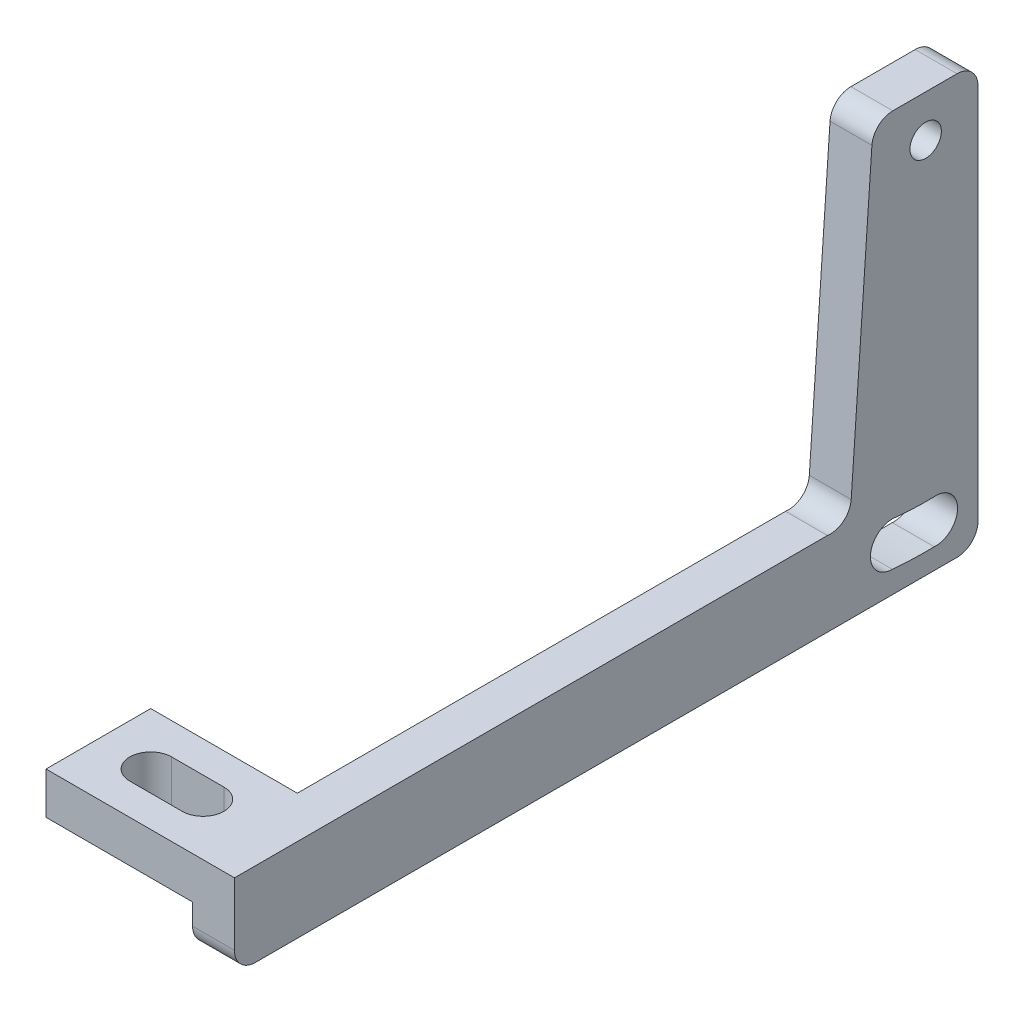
ISO-10303-21;
HEADER;
FILE_DESCRIPTION(('STEP AP214'),'2;1');
FILE_NAME('part.step','',(''),(''),'','','');
FILE_SCHEMA(('AUTOMOTIVE_DESIGN { 1 0 10303 214 1 1 1 1 }'));
ENDSEC;
DATA;
#1=APPLICATION_CONTEXT('core data for automotive mechanical design processes');
#2=APPLICATION_PROTOCOL_DEFINITION('international standard','automotive_design',2000,#1);
#3=PRODUCT_CONTEXT('',#1,'mechanical');
#4=PRODUCT('Part','Part','',(#3));
#5=PRODUCT_RELATED_PRODUCT_CATEGORY('part','',(#4));
#6=PRODUCT_DEFINITION_FORMATION('','',#4);
#7=PRODUCT_DEFINITION_CONTEXT('part definition',#1,'design');
#8=PRODUCT_DEFINITION('design','',#6,#7);
#9=PRODUCT_DEFINITION_SHAPE('','',#8);
#10=(LENGTH_UNIT() NAMED_UNIT(*) SI_UNIT(.MILLI.,.METRE.));
#11=(NAMED_UNIT(*) PLANE_ANGLE_UNIT() SI_UNIT($,.RADIAN.));
#12=(NAMED_UNIT(*) SI_UNIT($,.STERADIAN.) SOLID_ANGLE_UNIT());
#13=UNCERTAINTY_MEASURE_WITH_UNIT(LENGTH_MEASURE(1.E-05),#10,'distance_accuracy_value','');
#14=(GEOMETRIC_REPRESENTATION_CONTEXT(3) GLOBAL_UNCERTAINTY_ASSIGNED_CONTEXT((#13)) GLOBAL_UNIT_ASSIGNED_CONTEXT((#10,
#11,#12)) REPRESENTATION_CONTEXT('',''));
#15=CARTESIAN_POINT('',(0.,0.,0.));
#16=DIRECTION('',(0.,0.,1.));
#17=DIRECTION('',(1.,0.,0.));
#18=AXIS2_PLACEMENT_3D('',#15,#16,#17);
#19=CARTESIAN_POINT('',(0.,-44.7113522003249,-90.6066732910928));
#20=DIRECTION('',(1.,0.,0.));
#21=DIRECTION('',(0.,0.,-1.));
#22=AXIS2_PLACEMENT_3D('',#19,#20,#21);
#23=PLANE('',#22);
#24=CARTESIAN_POINT('',(0.,-50.7288013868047,-1.53453655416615));
#25=DIRECTION('',(1.,0.,0.));
#26=DIRECTION('',(0.,0.,-1.));
#27=AXIS2_PLACEMENT_3D('',#24,#25,#26);
#28=CIRCLE('',#27,3.30199999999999);
#29=CARTESIAN_POINT('',(0.,-54.0217341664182,-1.29000085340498));
#30=VERTEX_POINT('',#29);
#31=CARTESIAN_POINT('',(0.,-47.4530595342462,-1.11894142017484));
#32=VERTEX_POINT('',#31);
#33=EDGE_CURVE('E389',#30,#32,#28,.T.);
#34=ORIENTED_EDGE('',*,*,#33,.T.);
#35=CARTESIAN_POINT('',(0.,0.,0.));
#36=DIRECTION('',(1.,0.,0.));
#37=DIRECTION('',(0.,0.,-1.));
#38=AXIS2_PLACEMENT_3D('',#35,#36,#37);
#39=CIRCLE('',#38,47.46625);
#40=CARTESIAN_POINT('',(0.,-47.2609856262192,4.40954948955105));
#41=VERTEX_POINT('',#40);
#42=EDGE_CURVE('E422',#41,#32,#39,.T.);
#43=ORIENTED_EDGE('',*,*,#42,.F.);
#44=CARTESIAN_POINT('',(0.,-50.4971968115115,5.06540096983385));
#45=DIRECTION('',(1.,0.,0.));
#46=DIRECTION('',(0.,0.,-1.));
#47=AXIS2_PLACEMENT_3D('',#44,#45,#46);
#48=CIRCLE('',#47,3.302);
#49=CARTESIAN_POINT('',(0.,-53.7991968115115,5.06540096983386));
#50=VERTEX_POINT('',#49);
#51=EDGE_CURVE('E426',#41,#50,#48,.T.);
#52=ORIENTED_EDGE('',*,*,#51,.T.);
#53=CARTESIAN_POINT('',(0.,0.,0.));
#54=DIRECTION('',(1.,0.,0.));
#55=DIRECTION('',(0.,0.,-1.));
#56=AXIS2_PLACEMENT_3D('',#53,#54,#55);
#57=CIRCLE('',#56,54.0371341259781);
#58=EDGE_CURVE('E428',#50,#30,#57,.T.);
#59=ORIENTED_EDGE('',*,*,#58,.T.);
#60=EDGE_LOOP('',(#34,#43,#52,#59));
#61=FACE_BOUND('',#60,.T.);
#62=CARTESIAN_POINT('',(0.,0.,0.));
#63=DIRECTION('',(1.,0.,0.));
#64=DIRECTION('',(0.,0.,-1.));
#65=AXIS2_PLACEMENT_3D('',#62,#63,#64);
#66=CIRCLE('',#65,2.38125);
#67=CARTESIAN_POINT('',(0.,0.,-2.38125));
#68=VERTEX_POINT('',#67);
#69=EDGE_CURVE('E358',#68,#68,#66,.T.);
#70=ORIENTED_EDGE('',*,*,#69,.T.);
#71=EDGE_LOOP('',(#70));
#72=FACE_BOUND('',#71,.T.);
#73=DIRECTION('',(0.,-1.,0.));
#74=VECTOR('',#73,1.);
#75=CARTESIAN_POINT('',(0.,-44.45,88.9));
#76=LINE('',#75,#74);
#77=CARTESIAN_POINT('',(0.,-44.45,88.9));
#78=VERTEX_POINT('',#77);
#79=CARTESIAN_POINT('',(0.,-50.8,88.9));
#80=VERTEX_POINT('',#79);
#81=EDGE_CURVE('E217',#78,#80,#76,.T.);
#82=ORIENTED_EDGE('',*,*,#81,.F.);
#83=DIRECTION('',(0.,0.,-1.));
#84=VECTOR('',#83,1.);
#85=CARTESIAN_POINT('',(0.,-44.45,-90.6066732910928));
#86=LINE('',#85,#84);
#87=CARTESIAN_POINT('',(0.,-44.45,14.8945527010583));
#88=VERTEX_POINT('',#87);
#89=EDGE_CURVE('E240',#78,#88,#86,.T.);
#90=ORIENTED_EDGE('',*,*,#89,.T.);
#91=CARTESIAN_POINT('',(0.,-41.3058988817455,14.4526781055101));
#92=DIRECTION('',(1.,0.,0.));
#93=DIRECTION('',(0.,0.,-1.));
#94=AXIS2_PLACEMENT_3D('',#91,#92,#93);
#95=CIRCLE('',#94,3.175);
#96=CARTESIAN_POINT('',(0.,-41.5273756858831,11.2854122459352));
#97=VERTEX_POINT('',#96);
#98=EDGE_CURVE('E383',#88,#97,#95,.T.);
#99=ORIENTED_EDGE('',*,*,#98,.T.);
#100=DIRECTION('',(0.,0.997564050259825,-0.0697564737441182));
#101=VECTOR('',#100,1.);
#102=CARTESIAN_POINT('',(0.,-37.605540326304,11.0111708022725));
#103=LINE('',#102,#101);
#104=CARTESIAN_POINT('',(0.,3.39647680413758,8.14403046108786));
#105=VERTEX_POINT('',#104);
#106=EDGE_CURVE('E380',#97,#105,#103,.T.);
#107=ORIENTED_EDGE('',*,*,#106,.T.);
#108=CARTESIAN_POINT('',(0.,3.175,4.97676460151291));
#109=DIRECTION('',(1.,0.,0.));
#110=DIRECTION('',(0.,0.,-1.));
#111=AXIS2_PLACEMENT_3D('',#108,#109,#110);
#112=CIRCLE('',#111,3.175);
#113=CARTESIAN_POINT('',(0.,6.35,4.9767646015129));
#114=VERTEX_POINT('',#113);
#115=EDGE_CURVE('E377',#114,#105,#112,.T.);
#116=ORIENTED_EDGE('',*,*,#115,.F.);
#117=DIRECTION('',(0.,0.,-1.));
#118=VECTOR('',#117,1.);
#119=CARTESIAN_POINT('',(0.,6.34999999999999,-90.6066732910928));
#120=LINE('',#119,#118);
#121=CARTESIAN_POINT('',(0.,6.35,-4.76249999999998));
#122=VERTEX_POINT('',#121);
#123=EDGE_CURVE('E374',#114,#122,#120,.T.);
#124=ORIENTED_EDGE('',*,*,#123,.T.);
#125=CARTESIAN_POINT('',(0.,3.175,-4.7625));
#126=DIRECTION('',(1.,0.,0.));
#127=DIRECTION('',(0.,0.,-1.));
#128=AXIS2_PLACEMENT_3D('',#125,#126,#127);
#129=CIRCLE('',#128,3.175);
#130=CARTESIAN_POINT('',(0.,3.17499999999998,-7.93750000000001));
#131=VERTEX_POINT('',#130);
#132=EDGE_CURVE('E371',#122,#131,#129,.F.);
#133=ORIENTED_EDGE('',*,*,#132,.T.);
#134=DIRECTION('',(0.,-1.,0.));
#135=VECTOR('',#134,1.);
#136=CARTESIAN_POINT('',(0.,-44.711352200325,-7.93750000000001));
#137=LINE('',#136,#135);
#138=CARTESIAN_POINT('',(0.,-53.975,-7.93750000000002));
#139=VERTEX_POINT('',#138);
#140=EDGE_CURVE('E366',#131,#139,#137,.T.);
#141=ORIENTED_EDGE('',*,*,#140,.T.);
#142=CARTESIAN_POINT('',(0.,-53.975,-4.76250000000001));
#143=DIRECTION('',(1.,0.,0.));
#144=DIRECTION('',(0.,0.,-1.));
#145=AXIS2_PLACEMENT_3D('',#142,#143,#144);
#146=CIRCLE('',#145,3.175);
#147=CARTESIAN_POINT('',(0.,-57.15,-4.76249999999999));
#148=VERTEX_POINT('',#147);
#149=EDGE_CURVE('E364',#139,#148,#146,.F.);
#150=ORIENTED_EDGE('',*,*,#149,.T.);
#151=DIRECTION('',(0.,0.,1.));
#152=VECTOR('',#151,1.);
#153=CARTESIAN_POINT('',(0.,-57.15,-90.6066732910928));
#154=LINE('',#153,#152);
#155=CARTESIAN_POINT('',(0.,-57.15,101.6));
#156=VERTEX_POINT('',#155);
#157=EDGE_CURVE('E357',#148,#156,#154,.T.);
#158=ORIENTED_EDGE('',*,*,#157,.T.);
#159=CARTESIAN_POINT('',(0.,-53.975,101.6));
#160=DIRECTION('',(1.,0.,0.));
#161=DIRECTION('',(0.,0.,-1.));
#162=AXIS2_PLACEMENT_3D('',#159,#160,#161);
#163=CIRCLE('',#162,3.175);
#164=CARTESIAN_POINT('',(0.,-53.975,104.775));
#165=VERTEX_POINT('',#164);
#166=EDGE_CURVE('E349',#156,#165,#163,.F.);
#167=ORIENTED_EDGE('',*,*,#166,.T.);
#168=DIRECTION('',(0.,1.,0.));
#169=VECTOR('',#168,1.);
#170=CARTESIAN_POINT('',(0.,-44.7113522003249,104.775));
#171=LINE('',#170,#169);
#172=CARTESIAN_POINT('',(0.,-50.8,104.775));
#173=VERTEX_POINT('',#172);
#174=EDGE_CURVE('E391',#165,#173,#171,.T.);
#175=ORIENTED_EDGE('',*,*,#174,.T.);
#176=DIRECTION('',(0.,0.,1.));
#177=VECTOR('',#176,1.);
#178=CARTESIAN_POINT('',(0.,-50.8,88.9));
#179=LINE('',#178,#177);
#180=EDGE_CURVE('E224',#80,#173,#179,.T.);
#181=ORIENTED_EDGE('',*,*,#180,.F.);
#182=EDGE_LOOP('',(#82,#90,#99,#107,#116,#124,#133,#141,#150,#158,#167,#175,#181));
#183=FACE_BOUND('',#182,.T.);
#184=ADVANCED_FACE('F42',(#61,#72,#183),#23,.F.);
#185=CARTESIAN_POINT('',(6.35,-50.7288013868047,-1.53453655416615));
#186=DIRECTION('',(-1.,0.,0.));
#187=DIRECTION('',(0.,0.,1.));
#188=AXIS2_PLACEMENT_3D('',#185,#186,#187);
#189=CYLINDRICAL_SURFACE('',#188,3.30199999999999);
#190=ORIENTED_EDGE('',*,*,#33,.F.);
#191=DIRECTION('',(-1.,0.,0.));
#192=VECTOR('',#191,1.);
#193=CARTESIAN_POINT('',(6.35,-54.0217341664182,-1.29000085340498));
#194=LINE('',#193,#192);
#195=CARTESIAN_POINT('',(6.35,-54.0217341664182,-1.29000085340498));
#196=VERTEX_POINT('',#195);
#197=EDGE_CURVE('E258',#196,#30,#194,.T.);
#198=ORIENTED_EDGE('',*,*,#197,.F.);
#199=CARTESIAN_POINT('',(6.35,-50.7288013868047,-1.53453655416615));
#200=DIRECTION('',(1.,0.,0.));
#201=DIRECTION('',(0.,0.,-1.));
#202=AXIS2_PLACEMENT_3D('',#199,#200,#201);
#203=CIRCLE('',#202,3.30199999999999);
#204=CARTESIAN_POINT('',(6.35,-47.4530595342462,-1.11894142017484));
#205=VERTEX_POINT('',#204);
#206=EDGE_CURVE('E437',#196,#205,#203,.T.);
#207=ORIENTED_EDGE('',*,*,#206,.T.);
#208=DIRECTION('',(-1.,0.,0.));
#209=VECTOR('',#208,1.);
#210=CARTESIAN_POINT('',(6.35,-47.4530595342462,-1.11894142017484));
#211=LINE('',#210,#209);
#212=EDGE_CURVE('E394',#205,#32,#211,.T.);
#213=ORIENTED_EDGE('',*,*,#212,.T.);
#214=EDGE_LOOP('',(#190,#198,#207,#213));
#215=FACE_BOUND('',#214,.T.);
#216=ADVANCED_FACE('F279',(#215),#189,.F.);
#217=CARTESIAN_POINT('',(6.35,0.,0.));
#218=DIRECTION('',(-1.,0.,0.));
#219=DIRECTION('',(0.,0.,1.));
#220=AXIS2_PLACEMENT_3D('',#217,#218,#219);
#221=CYLINDRICAL_SURFACE('',#220,54.0371341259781);
#222=ORIENTED_EDGE('',*,*,#58,.F.);
#223=DIRECTION('',(-1.,0.,0.));
#224=VECTOR('',#223,1.);
#225=CARTESIAN_POINT('',(6.35,-53.7991968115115,5.06540096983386));
#226=LINE('',#225,#224);
#227=CARTESIAN_POINT('',(6.35,-53.7991968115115,5.06540096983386));
#228=VERTEX_POINT('',#227);
#229=EDGE_CURVE('E417',#228,#50,#226,.T.);
#230=ORIENTED_EDGE('',*,*,#229,.F.);
#231=CARTESIAN_POINT('',(6.35,0.,0.));
#232=DIRECTION('',(1.,0.,0.));
#233=DIRECTION('',(0.,0.,-1.));
#234=AXIS2_PLACEMENT_3D('',#231,#232,#233);
#235=CIRCLE('',#234,54.0371341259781);
#236=EDGE_CURVE('E444',#228,#196,#235,.T.);
#237=ORIENTED_EDGE('',*,*,#236,.T.);
#238=ORIENTED_EDGE('',*,*,#197,.T.);
#239=EDGE_LOOP('',(#222,#230,#237,#238));
#240=FACE_BOUND('',#239,.T.);
#241=ADVANCED_FACE('F285',(#240),#221,.F.);
#242=CARTESIAN_POINT('',(6.35,-50.4971968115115,5.06540096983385));
#243=DIRECTION('',(-1.,0.,0.));
#244=DIRECTION('',(0.,0.,1.));
#245=AXIS2_PLACEMENT_3D('',#242,#243,#244);
#246=CYLINDRICAL_SURFACE('',#245,3.302);
#247=ORIENTED_EDGE('',*,*,#51,.F.);
#248=DIRECTION('',(-1.,0.,0.));
#249=VECTOR('',#248,1.);
#250=CARTESIAN_POINT('',(6.35,-47.2609856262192,4.40954948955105));
#251=LINE('',#250,#249);
#252=CARTESIAN_POINT('',(6.35,-47.2609856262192,4.40954948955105));
#253=VERTEX_POINT('',#252);
#254=EDGE_CURVE('E419',#253,#41,#251,.T.);
#255=ORIENTED_EDGE('',*,*,#254,.F.);
#256=CARTESIAN_POINT('',(6.35,-50.4971968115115,5.06540096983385));
#257=DIRECTION('',(1.,0.,0.));
#258=DIRECTION('',(0.,0.,-1.));
#259=AXIS2_PLACEMENT_3D('',#256,#257,#258);
#260=CIRCLE('',#259,3.302);
#261=EDGE_CURVE('E441',#253,#228,#260,.T.);
#262=ORIENTED_EDGE('',*,*,#261,.T.);
#263=ORIENTED_EDGE('',*,*,#229,.T.);
#264=EDGE_LOOP('',(#247,#255,#262,#263));
#265=FACE_BOUND('',#264,.T.);
#266=ADVANCED_FACE('F298',(#265),#246,.F.);
#267=CARTESIAN_POINT('',(6.35,-53.975,101.6));
#268=DIRECTION('',(-1.,0.,0.));
#269=DIRECTION('',(0.,0.,1.));
#270=AXIS2_PLACEMENT_3D('',#267,#268,#269);
#271=CYLINDRICAL_SURFACE('',#270,3.175);
#272=ORIENTED_EDGE('',*,*,#166,.F.);
#273=DIRECTION('',(-1.,0.,0.));
#274=VECTOR('',#273,1.);
#275=CARTESIAN_POINT('',(6.35,-57.15,101.6));
#276=LINE('',#275,#274);
#277=CARTESIAN_POINT('',(6.35,-57.15,101.6));
#278=VERTEX_POINT('',#277);
#279=EDGE_CURVE('E352',#278,#156,#276,.T.);
#280=ORIENTED_EDGE('',*,*,#279,.F.);
#281=CARTESIAN_POINT('',(6.35,-53.975,101.6));
#282=DIRECTION('',(1.,0.,0.));
#283=DIRECTION('',(0.,0.,-1.));
#284=AXIS2_PLACEMENT_3D('',#281,#282,#283);
#285=CIRCLE('',#284,3.175);
#286=CARTESIAN_POINT('',(6.35,-53.975,104.775));
#287=VERTEX_POINT('',#286);
#288=EDGE_CURVE('E497',#278,#287,#285,.F.);
#289=ORIENTED_EDGE('',*,*,#288,.T.);
#290=DIRECTION('',(-1.,0.,0.));
#291=VECTOR('',#290,1.);
#292=CARTESIAN_POINT('',(6.35,-53.975,104.775));
#293=LINE('',#292,#291);
#294=EDGE_CURVE('E354',#287,#165,#293,.T.);
#295=ORIENTED_EDGE('',*,*,#294,.T.);
#296=EDGE_LOOP('',(#272,#280,#289,#295));
#297=FACE_BOUND('',#296,.T.);
#298=ADVANCED_FACE('F301',(#297),#271,.T.);
#299=CARTESIAN_POINT('',(6.35,-57.15,-90.6066732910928));
#300=DIRECTION('',(0.,-1.,0.));
#301=DIRECTION('',(0.,0.,-1.));
#302=AXIS2_PLACEMENT_3D('',#299,#300,#301);
#303=PLANE('',#302);
#304=ORIENTED_EDGE('',*,*,#157,.F.);
#305=DIRECTION('',(-1.,0.,0.));
#306=VECTOR('',#305,1.);
#307=CARTESIAN_POINT('',(6.35,-57.15,-4.76249999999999));
#308=LINE('',#307,#306);
#309=CARTESIAN_POINT('',(6.35,-57.15,-4.76249999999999));
#310=VERTEX_POINT('',#309);
#311=EDGE_CURVE('E395',#310,#148,#308,.T.);
#312=ORIENTED_EDGE('',*,*,#311,.F.);
#313=DIRECTION('',(0.,0.,1.));
#314=VECTOR('',#313,1.);
#315=CARTESIAN_POINT('',(6.35,-57.15,-90.6066732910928));
#316=LINE('',#315,#314);
#317=EDGE_CURVE('E494',#310,#278,#316,.T.);
#318=ORIENTED_EDGE('',*,*,#317,.T.);
#319=ORIENTED_EDGE('',*,*,#279,.T.);
#320=EDGE_LOOP('',(#304,#312,#318,#319));
#321=FACE_BOUND('',#320,.T.);
#322=ADVANCED_FACE('F339',(#321),#303,.T.);
#323=CARTESIAN_POINT('',(6.35,-53.975,-4.76250000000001));
#324=DIRECTION('',(-1.,0.,0.));
#325=DIRECTION('',(0.,0.,1.));
#326=AXIS2_PLACEMENT_3D('',#323,#324,#325);
#327=CYLINDRICAL_SURFACE('',#326,3.175);
#328=ORIENTED_EDGE('',*,*,#149,.F.);
#329=DIRECTION('',(-1.,0.,0.));
#330=VECTOR('',#329,1.);
#331=CARTESIAN_POINT('',(6.35,-53.975,-7.93750000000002));
#332=LINE('',#331,#330);
#333=CARTESIAN_POINT('',(6.35,-53.975,-7.93750000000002));
#334=VERTEX_POINT('',#333);
#335=EDGE_CURVE('E397',#334,#139,#332,.T.);
#336=ORIENTED_EDGE('',*,*,#335,.F.);
#337=CARTESIAN_POINT('',(6.35,-53.975,-4.76250000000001));
#338=DIRECTION('',(1.,0.,0.));
#339=DIRECTION('',(0.,0.,-1.));
#340=AXIS2_PLACEMENT_3D('',#337,#338,#339);
#341=CIRCLE('',#340,3.175);
#342=EDGE_CURVE('E491',#334,#310,#341,.F.);
#343=ORIENTED_EDGE('',*,*,#342,.T.);
#344=ORIENTED_EDGE('',*,*,#311,.T.);
#345=EDGE_LOOP('',(#328,#336,#343,#344));
#346=FACE_BOUND('',#345,.T.);
#347=ADVANCED_FACE('F335',(#346),#327,.T.);
#348=CARTESIAN_POINT('',(6.35,-44.711352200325,-7.93750000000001));
#349=DIRECTION('',(0.,0.,-1.));
#350=DIRECTION('',(0.,1.,0.));
#351=AXIS2_PLACEMENT_3D('',#348,#349,#350);
#352=PLANE('',#351);
#353=ORIENTED_EDGE('',*,*,#140,.F.);
#354=DIRECTION('',(-1.,0.,0.));
#355=VECTOR('',#354,1.);
#356=CARTESIAN_POINT('',(6.35,3.17499999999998,-7.93750000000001));
#357=LINE('',#356,#355);
#358=CARTESIAN_POINT('',(6.35,3.17499999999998,-7.93750000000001));
#359=VERTEX_POINT('',#358);
#360=EDGE_CURVE('E399',#359,#131,#357,.T.);
#361=ORIENTED_EDGE('',*,*,#360,.F.);
#362=DIRECTION('',(0.,-1.,0.));
#363=VECTOR('',#362,1.);
#364=CARTESIAN_POINT('',(6.35,-44.711352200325,-7.93750000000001));
#365=LINE('',#364,#363);
#366=EDGE_CURVE('E488',#359,#334,#365,.T.);
#367=ORIENTED_EDGE('',*,*,#366,.T.);
#368=ORIENTED_EDGE('',*,*,#335,.T.);
#369=EDGE_LOOP('',(#353,#361,#367,#368));
#370=FACE_BOUND('',#369,.T.);
#371=ADVANCED_FACE('F331',(#370),#352,.T.);
#372=CARTESIAN_POINT('',(6.35,3.175,-4.7625));
#373=DIRECTION('',(-1.,0.,0.));
#374=DIRECTION('',(0.,0.,1.));
#375=AXIS2_PLACEMENT_3D('',#372,#373,#374);
#376=CYLINDRICAL_SURFACE('',#375,3.175);
#377=ORIENTED_EDGE('',*,*,#132,.F.);
#378=DIRECTION('',(-1.,0.,0.));
#379=VECTOR('',#378,1.);
#380=CARTESIAN_POINT('',(6.35,6.35,-4.76249999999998));
#381=LINE('',#380,#379);
#382=CARTESIAN_POINT('',(6.35,6.35,-4.76249999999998));
#383=VERTEX_POINT('',#382);
#384=EDGE_CURVE('E401',#383,#122,#381,.T.);
#385=ORIENTED_EDGE('',*,*,#384,.F.);
#386=CARTESIAN_POINT('',(6.35,3.175,-4.7625));
#387=DIRECTION('',(1.,0.,0.));
#388=DIRECTION('',(0.,0.,-1.));
#389=AXIS2_PLACEMENT_3D('',#386,#387,#388);
#390=CIRCLE('',#389,3.175);
#391=EDGE_CURVE('E485',#383,#359,#390,.F.);
#392=ORIENTED_EDGE('',*,*,#391,.T.);
#393=ORIENTED_EDGE('',*,*,#360,.T.);
#394=EDGE_LOOP('',(#377,#385,#392,#393));
#395=FACE_BOUND('',#394,.T.);
#396=ADVANCED_FACE('F327',(#395),#376,.T.);
#397=CARTESIAN_POINT('',(6.35,6.34999999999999,-90.6066732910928));
#398=DIRECTION('',(0.,1.,0.));
#399=DIRECTION('',(0.,0.,1.));
#400=AXIS2_PLACEMENT_3D('',#397,#398,#399);
#401=PLANE('',#400);
#402=ORIENTED_EDGE('',*,*,#123,.F.);
#403=DIRECTION('',(-1.,0.,0.));
#404=VECTOR('',#403,1.);
#405=CARTESIAN_POINT('',(6.35,6.35,4.9767646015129));
#406=LINE('',#405,#404);
#407=CARTESIAN_POINT('',(6.35,6.35,4.9767646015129));
#408=VERTEX_POINT('',#407);
#409=EDGE_CURVE('E403',#408,#114,#406,.T.);
#410=ORIENTED_EDGE('',*,*,#409,.F.);
#411=DIRECTION('',(0.,0.,-1.));
#412=VECTOR('',#411,1.);
#413=CARTESIAN_POINT('',(6.35,6.34999999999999,-90.6066732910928));
#414=LINE('',#413,#412);
#415=EDGE_CURVE('E480',#408,#383,#414,.T.);
#416=ORIENTED_EDGE('',*,*,#415,.T.);
#417=ORIENTED_EDGE('',*,*,#384,.T.);
#418=EDGE_LOOP('',(#402,#410,#416,#417));
#419=FACE_BOUND('',#418,.T.);
#420=ADVANCED_FACE('F323',(#419),#401,.T.);
#421=CARTESIAN_POINT('',(6.35,3.175,4.97676460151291));
#422=DIRECTION('',(-1.,0.,0.));
#423=DIRECTION('',(0.,0.,1.));
#424=AXIS2_PLACEMENT_3D('',#421,#422,#423);
#425=CYLINDRICAL_SURFACE('',#424,3.175);
#426=ORIENTED_EDGE('',*,*,#115,.T.);
#427=DIRECTION('',(-1.,0.,0.));
#428=VECTOR('',#427,1.);
#429=CARTESIAN_POINT('',(6.35,3.39647680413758,8.14403046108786));
#430=LINE('',#429,#428);
#431=CARTESIAN_POINT('',(6.35,3.39647680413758,8.14403046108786));
#432=VERTEX_POINT('',#431);
#433=EDGE_CURVE('E405',#432,#105,#430,.T.);
#434=ORIENTED_EDGE('',*,*,#433,.F.);
#435=CARTESIAN_POINT('',(6.35,3.175,4.97676460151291));
#436=DIRECTION('',(1.,0.,0.));
#437=DIRECTION('',(0.,0.,-1.));
#438=AXIS2_PLACEMENT_3D('',#435,#436,#437);
#439=CIRCLE('',#438,3.175);
#440=EDGE_CURVE('E477',#408,#432,#439,.T.);
#441=ORIENTED_EDGE('',*,*,#440,.F.);
#442=ORIENTED_EDGE('',*,*,#409,.T.);
#443=EDGE_LOOP('',(#426,#434,#441,#442));
#444=FACE_BOUND('',#443,.T.);
#445=ADVANCED_FACE('F319',(#444),#425,.T.);
#446=CARTESIAN_POINT('',(6.35,-37.605540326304,11.0111708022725));
#447=DIRECTION('',(0.,0.0697564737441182,0.997564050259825));
#448=DIRECTION('',(0.,-0.997564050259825,0.0697564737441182));
#449=AXIS2_PLACEMENT_3D('',#446,#447,#448);
#450=PLANE('',#449);
#451=ORIENTED_EDGE('',*,*,#106,.F.);
#452=DIRECTION('',(-1.,0.,0.));
#453=VECTOR('',#452,1.);
#454=CARTESIAN_POINT('',(6.35,-41.5273756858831,11.2854122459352));
#455=LINE('',#454,#453);
#456=CARTESIAN_POINT('',(6.35,-41.5273756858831,11.2854122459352));
#457=VERTEX_POINT('',#456);
#458=EDGE_CURVE('E407',#457,#97,#455,.T.);
#459=ORIENTED_EDGE('',*,*,#458,.F.);
#460=DIRECTION('',(0.,0.997564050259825,-0.0697564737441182));
#461=VECTOR('',#460,1.);
#462=CARTESIAN_POINT('',(6.35,-37.605540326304,11.0111708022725));
#463=LINE('',#462,#461);
#464=EDGE_CURVE('E475',#457,#432,#463,.T.);
#465=ORIENTED_EDGE('',*,*,#464,.T.);
#466=ORIENTED_EDGE('',*,*,#433,.T.);
#467=EDGE_LOOP('',(#451,#459,#465,#466));
#468=FACE_BOUND('',#467,.T.);
#469=ADVANCED_FACE('F315',(#468),#450,.T.);
#470=CARTESIAN_POINT('',(6.35,-41.3058988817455,14.4526781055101));
#471=DIRECTION('',(-1.,0.,0.));
#472=DIRECTION('',(0.,0.,1.));
#473=AXIS2_PLACEMENT_3D('',#470,#471,#472);
#474=CYLINDRICAL_SURFACE('',#473,3.175);
#475=ORIENTED_EDGE('',*,*,#98,.F.);
#476=DIRECTION('',(-1.,0.,0.));
#477=VECTOR('',#476,1.);
#478=CARTESIAN_POINT('',(6.35,-44.45,14.8945527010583));
#479=LINE('',#478,#477);
#480=CARTESIAN_POINT('',(6.35,-44.45,14.8945527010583));
#481=VERTEX_POINT('',#480);
#482=EDGE_CURVE('E409',#481,#88,#479,.T.);
#483=ORIENTED_EDGE('',*,*,#482,.F.);
#484=CARTESIAN_POINT('',(6.35,-41.3058988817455,14.4526781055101));
#485=DIRECTION('',(1.,0.,0.));
#486=DIRECTION('',(0.,0.,-1.));
#487=AXIS2_PLACEMENT_3D('',#484,#485,#486);
#488=CIRCLE('',#487,3.175);
#489=EDGE_CURVE('E507',#481,#457,#488,.T.);
#490=ORIENTED_EDGE('',*,*,#489,.T.);
#491=ORIENTED_EDGE('',*,*,#458,.T.);
#492=EDGE_LOOP('',(#475,#483,#490,#491));
#493=FACE_BOUND('',#492,.T.);
#494=ADVANCED_FACE('F312',(#493),#474,.F.);
#495=CARTESIAN_POINT('',(6.35,-44.45,-90.6066732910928));
#496=DIRECTION('',(0.,1.,0.));
#497=DIRECTION('',(0.,0.,1.));
#498=AXIS2_PLACEMENT_3D('',#495,#496,#497);
#499=PLANE('',#498);
#500=CARTESIAN_POINT('',(-6.35,-44.45,96.8375));
#501=DIRECTION('',(0.,1.,0.));
#502=DIRECTION('',(0.,0.,1.));
#503=AXIS2_PLACEMENT_3D('',#500,#501,#502);
#504=CIRCLE('',#503,3.175);
#505=CARTESIAN_POINT('',(-6.35,-44.45,100.0125));
#506=VERTEX_POINT('',#505);
#507=CARTESIAN_POINT('',(-6.35,-44.45,93.6625));
#508=VERTEX_POINT('',#507);
#509=EDGE_CURVE('E57',#506,#508,#504,.T.);
#510=ORIENTED_EDGE('',*,*,#509,.F.);
#511=DIRECTION('',(1.,0.,0.));
#512=VECTOR('',#511,1.);
#513=CARTESIAN_POINT('',(-6.35,-44.45,100.0125));
#514=LINE('',#513,#512);
#515=CARTESIAN_POINT('',(-14.2875,-44.45,100.0125));
#516=VERTEX_POINT('',#515);
#517=EDGE_CURVE('E210',#516,#506,#514,.T.);
#518=ORIENTED_EDGE('',*,*,#517,.F.);
#519=CARTESIAN_POINT('',(-14.2875,-44.45,96.8375));
#520=DIRECTION('',(0.,1.,0.));
#521=DIRECTION('',(0.,0.,1.));
#522=AXIS2_PLACEMENT_3D('',#519,#520,#521);
#523=CIRCLE('',#522,3.175);
#524=CARTESIAN_POINT('',(-14.2875,-44.45,93.6625));
#525=VERTEX_POINT('',#524);
#526=EDGE_CURVE('E194',#525,#516,#523,.T.);
#527=ORIENTED_EDGE('',*,*,#526,.F.);
#528=DIRECTION('',(-1.,0.,0.));
#529=VECTOR('',#528,1.);
#530=CARTESIAN_POINT('',(-6.35,-44.45,93.6625));
#531=LINE('',#530,#529);
#532=EDGE_CURVE('E203',#508,#525,#531,.T.);
#533=ORIENTED_EDGE('',*,*,#532,.F.);
#534=EDGE_LOOP('',(#510,#518,#527,#533));
#535=FACE_BOUND('',#534,.T.);
#536=ORIENTED_EDGE('',*,*,#89,.F.);
#537=DIRECTION('',(1.,0.,0.));
#538=VECTOR('',#537,1.);
#539=CARTESIAN_POINT('',(-22.225,-44.45,88.9));
#540=LINE('',#539,#538);
#541=CARTESIAN_POINT('',(-22.225,-44.45,88.9));
#542=VERTEX_POINT('',#541);
#543=EDGE_CURVE('E231',#542,#78,#540,.T.);
#544=ORIENTED_EDGE('',*,*,#543,.F.);
#545=DIRECTION('',(0.,0.,-1.));
#546=VECTOR('',#545,1.);
#547=CARTESIAN_POINT('',(-22.225,-44.45,88.9));
#548=LINE('',#547,#546);
#549=CARTESIAN_POINT('',(-22.225,-44.45,104.775));
#550=VERTEX_POINT('',#549);
#551=EDGE_CURVE('E229',#550,#542,#548,.T.);
#552=ORIENTED_EDGE('',*,*,#551,.F.);
#553=DIRECTION('',(-1.,0.,0.));
#554=VECTOR('',#553,1.);
#555=CARTESIAN_POINT('',(6.35,-44.45,104.775));
#556=LINE('',#555,#554);
#557=CARTESIAN_POINT('',(6.35,-44.45,104.775));
#558=VERTEX_POINT('',#557);
#559=EDGE_CURVE('E412',#558,#550,#556,.T.);
#560=ORIENTED_EDGE('',*,*,#559,.F.);
#561=DIRECTION('',(0.,0.,-1.));
#562=VECTOR('',#561,1.);
#563=CARTESIAN_POINT('',(6.35,-44.45,-90.6066732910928));
#564=LINE('',#563,#562);
#565=EDGE_CURVE('E466',#558,#481,#564,.T.);
#566=ORIENTED_EDGE('',*,*,#565,.T.);
#567=ORIENTED_EDGE('',*,*,#482,.T.);
#568=EDGE_LOOP('',(#536,#544,#552,#560,#566,#567));
#569=FACE_BOUND('',#568,.T.);
#570=ADVANCED_FACE('F207',(#535,#569),#499,.T.);
#571=CARTESIAN_POINT('',(6.35,-44.7113522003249,104.775));
#572=DIRECTION('',(0.,0.,1.));
#573=DIRECTION('',(1.,0.,0.));
#574=AXIS2_PLACEMENT_3D('',#571,#572,#573);
#575=PLANE('',#574);
#576=ORIENTED_EDGE('',*,*,#174,.F.);
#577=ORIENTED_EDGE('',*,*,#294,.F.);
#578=DIRECTION('',(0.,1.,0.));
#579=VECTOR('',#578,1.);
#580=CARTESIAN_POINT('',(6.35,-44.7113522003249,104.775));
#581=LINE('',#580,#579);
#582=EDGE_CURVE('E448',#287,#558,#581,.T.);
#583=ORIENTED_EDGE('',*,*,#582,.T.);
#584=ORIENTED_EDGE('',*,*,#559,.T.);
#585=DIRECTION('',(0.,1.,0.));
#586=VECTOR('',#585,1.);
#587=CARTESIAN_POINT('',(-22.225,-44.45,104.775));
#588=LINE('',#587,#586);
#589=CARTESIAN_POINT('',(-22.225,-50.8,104.775));
#590=VERTEX_POINT('',#589);
#591=EDGE_CURVE('E226',#590,#550,#588,.T.);
#592=ORIENTED_EDGE('',*,*,#591,.F.);
#593=DIRECTION('',(1.,0.,0.));
#594=VECTOR('',#593,1.);
#595=CARTESIAN_POINT('',(-22.225,-50.8,104.775));
#596=LINE('',#595,#594);
#597=EDGE_CURVE('E243',#590,#173,#596,.T.);
#598=ORIENTED_EDGE('',*,*,#597,.T.);
#599=EDGE_LOOP('',(#576,#577,#583,#584,#592,#598));
#600=FACE_BOUND('',#599,.T.);
#601=ADVANCED_FACE('F306',(#600),#575,.T.);
#602=CARTESIAN_POINT('',(6.35,0.,0.));
#603=DIRECTION('',(-1.,0.,0.));
#604=DIRECTION('',(0.,0.,1.));
#605=AXIS2_PLACEMENT_3D('',#602,#603,#604);
#606=CYLINDRICAL_SURFACE('',#605,2.38125);
#607=CARTESIAN_POINT('',(6.35,0.,0.));
#608=DIRECTION('',(1.,0.,0.));
#609=DIRECTION('',(0.,0.,-1.));
#610=AXIS2_PLACEMENT_3D('',#607,#608,#609);
#611=CIRCLE('',#610,2.38125);
#612=CARTESIAN_POINT('',(6.35,0.,-2.38125));
#613=VERTEX_POINT('',#612);
#614=EDGE_CURVE('E425',#613,#613,#611,.T.);
#615=ORIENTED_EDGE('',*,*,#614,.T.);
#616=EDGE_LOOP('',(#615));
#617=FACE_BOUND('',#616,.T.);
#618=ORIENTED_EDGE('',*,*,#69,.F.);
#619=EDGE_LOOP('',(#618));
#620=FACE_BOUND('',#619,.T.);
#621=ADVANCED_FACE('F44',(#617,#620),#606,.F.);
#622=CARTESIAN_POINT('',(6.35,0.,0.));
#623=DIRECTION('',(-1.,0.,0.));
#624=DIRECTION('',(0.,0.,1.));
#625=AXIS2_PLACEMENT_3D('',#622,#623,#624);
#626=CYLINDRICAL_SURFACE('',#625,47.46625);
#627=ORIENTED_EDGE('',*,*,#42,.T.);
#628=ORIENTED_EDGE('',*,*,#212,.F.);
#629=CARTESIAN_POINT('',(6.35,0.,0.));
#630=DIRECTION('',(1.,0.,0.));
#631=DIRECTION('',(0.,0.,-1.));
#632=AXIS2_PLACEMENT_3D('',#629,#630,#631);
#633=CIRCLE('',#632,47.46625);
#634=EDGE_CURVE('E415',#253,#205,#633,.T.);
#635=ORIENTED_EDGE('',*,*,#634,.F.);
#636=ORIENTED_EDGE('',*,*,#254,.T.);
#637=EDGE_LOOP('',(#627,#628,#635,#636));
#638=FACE_BOUND('',#637,.T.);
#639=ADVANCED_FACE('F294',(#638),#626,.T.);
#640=CARTESIAN_POINT('',(6.35,-44.7113522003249,-90.6066732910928));
#641=DIRECTION('',(1.,0.,0.));
#642=DIRECTION('',(0.,0.,-1.));
#643=AXIS2_PLACEMENT_3D('',#640,#641,#642);
#644=PLANE('',#643);
#645=ORIENTED_EDGE('',*,*,#614,.F.);
#646=EDGE_LOOP('',(#645));
#647=FACE_BOUND('',#646,.T.);
#648=ORIENTED_EDGE('',*,*,#288,.F.);
#649=ORIENTED_EDGE('',*,*,#317,.F.);
#650=ORIENTED_EDGE('',*,*,#342,.F.);
#651=ORIENTED_EDGE('',*,*,#366,.F.);
#652=ORIENTED_EDGE('',*,*,#391,.F.);
#653=ORIENTED_EDGE('',*,*,#415,.F.);
#654=ORIENTED_EDGE('',*,*,#440,.T.);
#655=ORIENTED_EDGE('',*,*,#464,.F.);
#656=ORIENTED_EDGE('',*,*,#489,.F.);
#657=ORIENTED_EDGE('',*,*,#565,.F.);
#658=ORIENTED_EDGE('',*,*,#582,.F.);
#659=EDGE_LOOP('',(#648,#649,#650,#651,#652,#653,#654,#655,#656,#657,#658));
#660=FACE_BOUND('',#659,.T.);
#661=ORIENTED_EDGE('',*,*,#206,.F.);
#662=ORIENTED_EDGE('',*,*,#236,.F.);
#663=ORIENTED_EDGE('',*,*,#261,.F.);
#664=ORIENTED_EDGE('',*,*,#634,.T.);
#665=EDGE_LOOP('',(#661,#662,#663,#664));
#666=FACE_BOUND('',#665,.T.);
#667=ADVANCED_FACE('F292',(#647,#660,#666),#644,.T.);
#668=CARTESIAN_POINT('',(-22.225,-44.45,88.9));
#669=DIRECTION('',(0.,0.,1.));
#670=DIRECTION('',(1.,0.,0.));
#671=AXIS2_PLACEMENT_3D('',#668,#669,#670);
#672=PLANE('',#671);
#673=ORIENTED_EDGE('',*,*,#81,.T.);
#674=DIRECTION('',(1.,0.,0.));
#675=VECTOR('',#674,1.);
#676=CARTESIAN_POINT('',(-22.225,-50.8,88.9));
#677=LINE('',#676,#675);
#678=CARTESIAN_POINT('',(-22.225,-50.8,88.9));
#679=VERTEX_POINT('',#678);
#680=EDGE_CURVE('E234',#679,#80,#677,.T.);
#681=ORIENTED_EDGE('',*,*,#680,.F.);
#682=DIRECTION('',(0.,-1.,0.));
#683=VECTOR('',#682,1.);
#684=CARTESIAN_POINT('',(-22.225,-44.45,88.9));
#685=LINE('',#684,#683);
#686=EDGE_CURVE('E220',#542,#679,#685,.T.);
#687=ORIENTED_EDGE('',*,*,#686,.F.);
#688=ORIENTED_EDGE('',*,*,#543,.T.);
#689=EDGE_LOOP('',(#673,#681,#687,#688));
#690=FACE_BOUND('',#689,.T.);
#691=ADVANCED_FACE('F459',(#690),#672,.F.);
#692=CARTESIAN_POINT('',(-22.225,-50.8,88.9));
#693=DIRECTION('',(0.,1.,0.));
#694=DIRECTION('',(0.,0.,1.));
#695=AXIS2_PLACEMENT_3D('',#692,#693,#694);
#696=PLANE('',#695);
#697=DIRECTION('',(1.,0.,0.));
#698=VECTOR('',#697,1.);
#699=CARTESIAN_POINT('',(-22.225,-50.8,100.0125));
#700=LINE('',#699,#698);
#701=CARTESIAN_POINT('',(-14.2875,-50.8,100.0125));
#702=VERTEX_POINT('',#701);
#703=CARTESIAN_POINT('',(-6.35,-50.8,100.0125));
#704=VERTEX_POINT('',#703);
#705=EDGE_CURVE('E50',#702,#704,#700,.T.);
#706=ORIENTED_EDGE('',*,*,#705,.T.);
#707=CARTESIAN_POINT('',(-6.35,-50.8,96.8375));
#708=DIRECTION('',(0.,1.,0.));
#709=DIRECTION('',(0.,0.,1.));
#710=AXIS2_PLACEMENT_3D('',#707,#708,#709);
#711=CIRCLE('',#710,3.175);
#712=CARTESIAN_POINT('',(-6.35,-50.8,93.6625));
#713=VERTEX_POINT('',#712);
#714=EDGE_CURVE('E13',#704,#713,#711,.T.);
#715=ORIENTED_EDGE('',*,*,#714,.T.);
#716=DIRECTION('',(-1.,0.,0.));
#717=VECTOR('',#716,1.);
#718=CARTESIAN_POINT('',(-22.225,-50.8,93.6625));
#719=LINE('',#718,#717);
#720=CARTESIAN_POINT('',(-14.2875,-50.8,93.6625));
#721=VERTEX_POINT('',#720);
#722=EDGE_CURVE('E256',#713,#721,#719,.T.);
#723=ORIENTED_EDGE('',*,*,#722,.T.);
#724=CARTESIAN_POINT('',(-14.2875,-50.8,96.8375));
#725=DIRECTION('',(0.,1.,0.));
#726=DIRECTION('',(0.,0.,1.));
#727=AXIS2_PLACEMENT_3D('',#724,#725,#726);
#728=CIRCLE('',#727,3.175);
#729=EDGE_CURVE('E197',#721,#702,#728,.T.);
#730=ORIENTED_EDGE('',*,*,#729,.T.);
#731=EDGE_LOOP('',(#706,#715,#723,#730));
#732=FACE_BOUND('',#731,.T.);
#733=ORIENTED_EDGE('',*,*,#180,.T.);
#734=ORIENTED_EDGE('',*,*,#597,.F.);
#735=DIRECTION('',(0.,0.,1.));
#736=VECTOR('',#735,1.);
#737=CARTESIAN_POINT('',(-22.225,-50.8,88.9));
#738=LINE('',#737,#736);
#739=EDGE_CURVE('E223',#679,#590,#738,.T.);
#740=ORIENTED_EDGE('',*,*,#739,.F.);
#741=ORIENTED_EDGE('',*,*,#680,.T.);
#742=EDGE_LOOP('',(#733,#734,#740,#741));
#743=FACE_BOUND('',#742,.T.);
#744=ADVANCED_FACE('F261',(#732,#743),#696,.F.);
#745=CARTESIAN_POINT('',(-22.225,-50.8,88.9));
#746=DIRECTION('',(-1.,0.,0.));
#747=DIRECTION('',(0.,0.,1.));
#748=AXIS2_PLACEMENT_3D('',#745,#746,#747);
#749=PLANE('',#748);
#750=ORIENTED_EDGE('',*,*,#686,.T.);
#751=ORIENTED_EDGE('',*,*,#739,.T.);
#752=ORIENTED_EDGE('',*,*,#591,.T.);
#753=ORIENTED_EDGE('',*,*,#551,.T.);
#754=EDGE_LOOP('',(#750,#751,#752,#753));
#755=FACE_BOUND('',#754,.T.);
#756=ADVANCED_FACE('F268',(#755),#749,.T.);
#757=CARTESIAN_POINT('',(-6.35,-57.15,96.8375));
#758=DIRECTION('',(0.,1.,0.));
#759=DIRECTION('',(0.,0.,1.));
#760=AXIS2_PLACEMENT_3D('',#757,#758,#759);
#761=CYLINDRICAL_SURFACE('',#760,3.175);
#762=DIRECTION('',(0.,1.,0.));
#763=VECTOR('',#762,1.);
#764=CARTESIAN_POINT('',(-6.35,-57.15,100.0125));
#765=LINE('',#764,#763);
#766=EDGE_CURVE('E215',#704,#506,#765,.T.);
#767=ORIENTED_EDGE('',*,*,#766,.T.);
#768=ORIENTED_EDGE('',*,*,#509,.T.);
#769=DIRECTION('',(0.,1.,0.));
#770=VECTOR('',#769,1.);
#771=CARTESIAN_POINT('',(-6.35,-57.15,93.6625));
#772=LINE('',#771,#770);
#773=EDGE_CURVE('E200',#713,#508,#772,.T.);
#774=ORIENTED_EDGE('',*,*,#773,.F.);
#775=ORIENTED_EDGE('',*,*,#714,.F.);
#776=EDGE_LOOP('',(#767,#768,#774,#775));
#777=FACE_BOUND('',#776,.T.);
#778=ADVANCED_FACE('F266',(#777),#761,.F.);
#779=CARTESIAN_POINT('',(-6.35,-57.15,100.0125));
#780=DIRECTION('',(0.,0.,1.));
#781=DIRECTION('',(1.,0.,0.));
#782=AXIS2_PLACEMENT_3D('',#779,#780,#781);
#783=PLANE('',#782);
#784=DIRECTION('',(0.,1.,0.));
#785=VECTOR('',#784,1.);
#786=CARTESIAN_POINT('',(-14.2875,-57.15,100.0125));
#787=LINE('',#786,#785);
#788=EDGE_CURVE('E199',#702,#516,#787,.T.);
#789=ORIENTED_EDGE('',*,*,#788,.T.);
#790=ORIENTED_EDGE('',*,*,#517,.T.);
#791=ORIENTED_EDGE('',*,*,#766,.F.);
#792=ORIENTED_EDGE('',*,*,#705,.F.);
#793=EDGE_LOOP('',(#789,#790,#791,#792));
#794=FACE_BOUND('',#793,.T.);
#795=ADVANCED_FACE('F265',(#794),#783,.F.);
#796=CARTESIAN_POINT('',(-14.2875,-57.15,96.8375));
#797=DIRECTION('',(0.,1.,0.));
#798=DIRECTION('',(0.,0.,1.));
#799=AXIS2_PLACEMENT_3D('',#796,#797,#798);
#800=CYLINDRICAL_SURFACE('',#799,3.175);
#801=DIRECTION('',(0.,1.,0.));
#802=VECTOR('',#801,1.);
#803=CARTESIAN_POINT('',(-14.2875,-57.15,93.6625));
#804=LINE('',#803,#802);
#805=EDGE_CURVE('E65',#721,#525,#804,.T.);
#806=ORIENTED_EDGE('',*,*,#805,.T.);
#807=ORIENTED_EDGE('',*,*,#526,.T.);
#808=ORIENTED_EDGE('',*,*,#788,.F.);
#809=ORIENTED_EDGE('',*,*,#729,.F.);
#810=EDGE_LOOP('',(#806,#807,#808,#809));
#811=FACE_BOUND('',#810,.T.);
#812=ADVANCED_FACE('F191',(#811),#800,.F.);
#813=CARTESIAN_POINT('',(-6.35,-57.15,93.6625));
#814=DIRECTION('',(0.,0.,-1.));
#815=DIRECTION('',(-1.,0.,0.));
#816=AXIS2_PLACEMENT_3D('',#813,#814,#815);
#817=PLANE('',#816);
#818=ORIENTED_EDGE('',*,*,#773,.T.);
#819=ORIENTED_EDGE('',*,*,#532,.T.);
#820=ORIENTED_EDGE('',*,*,#805,.F.);
#821=ORIENTED_EDGE('',*,*,#722,.F.);
#822=EDGE_LOOP('',(#818,#819,#820,#821));
#823=FACE_BOUND('',#822,.T.);
#824=ADVANCED_FACE('F204',(#823),#817,.F.);
#825=CLOSED_SHELL('',(#184,#216,#241,#266,#298,#322,#347,#371,#396,#420,#445,#469,#494,#570,
#601,#621,#639,#667,#691,#744,#756,#778,#795,#812,#824));
#826=MANIFOLD_SOLID_BREP('B2',#825);
#827=ADVANCED_BREP_SHAPE_REPRESENTATION('',(#18,#826),#14);
#828=SHAPE_DEFINITION_REPRESENTATION(#9,#827);
ENDSEC;
END-ISO-10303-21;
